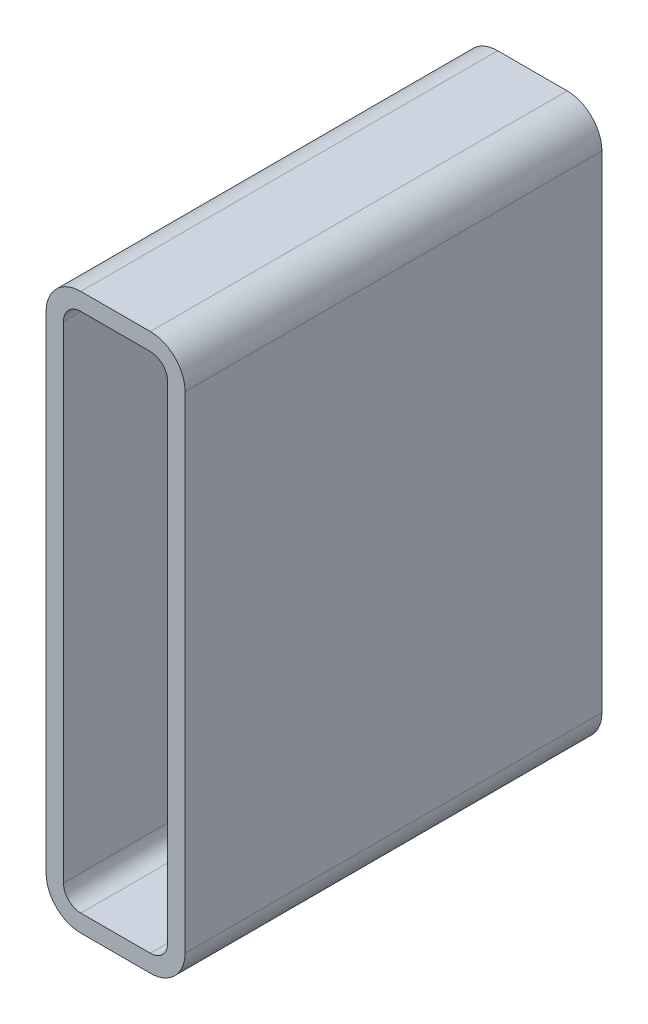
ISO-10303-21;
HEADER;
FILE_DESCRIPTION(('STEP AP214'),'2;1');
FILE_NAME('part.step','',(''),(''),'','','');
FILE_SCHEMA(('AUTOMOTIVE_DESIGN { 1 0 10303 214 1 1 1 1 }'));
ENDSEC;
DATA;
#1=APPLICATION_CONTEXT('core data for automotive mechanical design processes');
#2=APPLICATION_PROTOCOL_DEFINITION('international standard','automotive_design',2000,#1);
#3=PRODUCT_CONTEXT('',#1,'mechanical');
#4=PRODUCT('Part','Part','',(#3));
#5=PRODUCT_RELATED_PRODUCT_CATEGORY('part','',(#4));
#6=PRODUCT_DEFINITION_FORMATION('','',#4);
#7=PRODUCT_DEFINITION_CONTEXT('part definition',#1,'design');
#8=PRODUCT_DEFINITION('design','',#6,#7);
#9=PRODUCT_DEFINITION_SHAPE('','',#8);
#10=(LENGTH_UNIT() NAMED_UNIT(*) SI_UNIT(.MILLI.,.METRE.));
#11=(NAMED_UNIT(*) PLANE_ANGLE_UNIT() SI_UNIT($,.RADIAN.));
#12=(NAMED_UNIT(*) SI_UNIT($,.STERADIAN.) SOLID_ANGLE_UNIT());
#13=UNCERTAINTY_MEASURE_WITH_UNIT(LENGTH_MEASURE(1.E-05),#10,'distance_accuracy_value','');
#14=(GEOMETRIC_REPRESENTATION_CONTEXT(3) GLOBAL_UNCERTAINTY_ASSIGNED_CONTEXT((#13)) GLOBAL_UNIT_ASSIGNED_CONTEXT((#10,
#11,#12)) REPRESENTATION_CONTEXT('',''));
#15=CARTESIAN_POINT('',(0.,0.,0.));
#16=DIRECTION('',(0.,0.,1.));
#17=DIRECTION('',(1.,0.,0.));
#18=AXIS2_PLACEMENT_3D('',#15,#16,#17);
#19=CARTESIAN_POINT('',(27.0751778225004,382.782862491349,304.8));
#20=DIRECTION('',(0.,0.,1.));
#21=DIRECTION('',(1.,0.,0.));
#22=AXIS2_PLACEMENT_3D('',#19,#20,#21);
#23=PLANE('',#22);
#24=CARTESIAN_POINT('',(27.0751778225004,382.782862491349,304.8));
#25=DIRECTION('',(0.,0.,1.));
#26=DIRECTION('',(1.,0.,0.));
#27=AXIS2_PLACEMENT_3D('',#24,#25,#26);
#28=CIRCLE('',#27,25.4);
#29=CARTESIAN_POINT('',(27.0751778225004,408.182862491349,304.8));
#30=VERTEX_POINT('',#29);
#31=CARTESIAN_POINT('',(1.67517782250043,382.782862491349,304.8));
#32=VERTEX_POINT('',#31);
#33=EDGE_CURVE('E211',#30,#32,#28,.T.);
#34=ORIENTED_EDGE('',*,*,#33,.T.);
#35=DIRECTION('',(0.,-1.,0.));
#36=VECTOR('',#35,1.);
#37=CARTESIAN_POINT('',(1.67517782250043,27.1828624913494,304.8));
#38=LINE('',#37,#36);
#39=CARTESIAN_POINT('',(1.67517782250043,27.1828624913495,304.8));
#40=VERTEX_POINT('',#39);
#41=EDGE_CURVE('E214',#32,#40,#38,.T.);
#42=ORIENTED_EDGE('',*,*,#41,.T.);
#43=CARTESIAN_POINT('',(27.0751778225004,27.1828624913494,304.8));
#44=DIRECTION('',(0.,0.,1.));
#45=DIRECTION('',(1.,0.,0.));
#46=AXIS2_PLACEMENT_3D('',#43,#44,#45);
#47=CIRCLE('',#46,25.4);
#48=CARTESIAN_POINT('',(27.0751778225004,1.78286249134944,304.8));
#49=VERTEX_POINT('',#48);
#50=EDGE_CURVE('E217',#40,#49,#47,.T.);
#51=ORIENTED_EDGE('',*,*,#50,.T.);
#52=DIRECTION('',(1.,0.,0.));
#53=VECTOR('',#52,1.);
#54=CARTESIAN_POINT('',(77.8751778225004,1.78286249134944,304.8));
#55=LINE('',#54,#53);
#56=CARTESIAN_POINT('',(77.8751778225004,1.78286249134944,304.8));
#57=VERTEX_POINT('',#56);
#58=EDGE_CURVE('E219',#49,#57,#55,.T.);
#59=ORIENTED_EDGE('',*,*,#58,.T.);
#60=CARTESIAN_POINT('',(77.8751778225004,27.1828624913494,304.8));
#61=DIRECTION('',(0.,0.,1.));
#62=DIRECTION('',(1.,0.,0.));
#63=AXIS2_PLACEMENT_3D('',#60,#61,#62);
#64=CIRCLE('',#63,25.4);
#65=CARTESIAN_POINT('',(103.2751778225,27.1828624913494,304.8));
#66=VERTEX_POINT('',#65);
#67=EDGE_CURVE('E221',#57,#66,#64,.T.);
#68=ORIENTED_EDGE('',*,*,#67,.T.);
#69=DIRECTION('',(0.,1.,0.));
#70=VECTOR('',#69,1.);
#71=CARTESIAN_POINT('',(103.2751778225,382.782862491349,304.8));
#72=LINE('',#71,#70);
#73=CARTESIAN_POINT('',(103.2751778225,382.782862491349,304.8));
#74=VERTEX_POINT('',#73);
#75=EDGE_CURVE('E223',#66,#74,#72,.T.);
#76=ORIENTED_EDGE('',*,*,#75,.T.);
#77=CARTESIAN_POINT('',(77.8751778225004,382.782862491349,304.8));
#78=DIRECTION('',(0.,0.,1.));
#79=DIRECTION('',(1.,0.,0.));
#80=AXIS2_PLACEMENT_3D('',#77,#78,#79);
#81=CIRCLE('',#80,25.4);
#82=CARTESIAN_POINT('',(77.8751778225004,408.182862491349,304.8));
#83=VERTEX_POINT('',#82);
#84=EDGE_CURVE('E225',#74,#83,#81,.T.);
#85=ORIENTED_EDGE('',*,*,#84,.T.);
#86=DIRECTION('',(-1.,0.,0.));
#87=VECTOR('',#86,1.);
#88=CARTESIAN_POINT('',(27.0751778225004,408.182862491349,304.8));
#89=LINE('',#88,#87);
#90=EDGE_CURVE('E227',#83,#30,#89,.T.);
#91=ORIENTED_EDGE('',*,*,#90,.T.);
#92=EDGE_LOOP('',(#34,#42,#51,#59,#68,#76,#85,#91));
#93=FACE_BOUND('',#92,.T.);
#94=DIRECTION('',(0.,-1.,0.));
#95=VECTOR('',#94,1.);
#96=CARTESIAN_POINT('',(14.3751778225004,27.1828624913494,304.8));
#97=LINE('',#96,#95);
#98=CARTESIAN_POINT('',(14.3751778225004,382.782862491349,304.8));
#99=VERTEX_POINT('',#98);
#100=CARTESIAN_POINT('',(14.3751778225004,27.1828624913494,304.8));
#101=VERTEX_POINT('',#100);
#102=EDGE_CURVE('E154',#99,#101,#97,.T.);
#103=ORIENTED_EDGE('',*,*,#102,.F.);
#104=CARTESIAN_POINT('',(27.0751778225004,382.782862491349,304.8));
#105=DIRECTION('',(0.,0.,1.));
#106=DIRECTION('',(1.,0.,0.));
#107=AXIS2_PLACEMENT_3D('',#104,#105,#106);
#108=CIRCLE('',#107,12.7);
#109=CARTESIAN_POINT('',(27.0751778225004,395.482862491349,304.8));
#110=VERTEX_POINT('',#109);
#111=EDGE_CURVE('E146',#110,#99,#108,.T.);
#112=ORIENTED_EDGE('',*,*,#111,.F.);
#113=DIRECTION('',(-1.,0.,0.));
#114=VECTOR('',#113,1.);
#115=CARTESIAN_POINT('',(27.0751778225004,395.482862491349,304.8));
#116=LINE('',#115,#114);
#117=CARTESIAN_POINT('',(77.8751778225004,395.482862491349,304.8));
#118=VERTEX_POINT('',#117);
#119=EDGE_CURVE('E179',#118,#110,#116,.T.);
#120=ORIENTED_EDGE('',*,*,#119,.F.);
#121=CARTESIAN_POINT('',(77.8751778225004,382.782862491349,304.8));
#122=DIRECTION('',(0.,0.,1.));
#123=DIRECTION('',(1.,0.,0.));
#124=AXIS2_PLACEMENT_3D('',#121,#122,#123);
#125=CIRCLE('',#124,12.7);
#126=CARTESIAN_POINT('',(90.5751778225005,382.782862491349,304.8));
#127=VERTEX_POINT('',#126);
#128=EDGE_CURVE('E177',#127,#118,#125,.T.);
#129=ORIENTED_EDGE('',*,*,#128,.F.);
#130=DIRECTION('',(0.,1.,0.));
#131=VECTOR('',#130,1.);
#132=CARTESIAN_POINT('',(90.5751778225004,382.782862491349,304.8));
#133=LINE('',#132,#131);
#134=CARTESIAN_POINT('',(90.5751778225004,27.1828624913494,304.8));
#135=VERTEX_POINT('',#134);
#136=EDGE_CURVE('E175',#135,#127,#133,.T.);
#137=ORIENTED_EDGE('',*,*,#136,.F.);
#138=CARTESIAN_POINT('',(77.8751778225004,27.1828624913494,304.8));
#139=DIRECTION('',(0.,0.,1.));
#140=DIRECTION('',(1.,0.,0.));
#141=AXIS2_PLACEMENT_3D('',#138,#139,#140);
#142=CIRCLE('',#141,12.7);
#143=CARTESIAN_POINT('',(77.8751778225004,14.4828624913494,304.8));
#144=VERTEX_POINT('',#143);
#145=EDGE_CURVE('E173',#144,#135,#142,.T.);
#146=ORIENTED_EDGE('',*,*,#145,.F.);
#147=DIRECTION('',(1.,0.,0.));
#148=VECTOR('',#147,1.);
#149=CARTESIAN_POINT('',(77.8751778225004,14.4828624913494,304.8));
#150=LINE('',#149,#148);
#151=CARTESIAN_POINT('',(27.0751778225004,14.4828624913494,304.8));
#152=VERTEX_POINT('',#151);
#153=EDGE_CURVE('E169',#152,#144,#150,.T.);
#154=ORIENTED_EDGE('',*,*,#153,.F.);
#155=CARTESIAN_POINT('',(27.0751778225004,27.1828624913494,304.8));
#156=DIRECTION('',(0.,0.,1.));
#157=DIRECTION('',(1.,0.,0.));
#158=AXIS2_PLACEMENT_3D('',#155,#156,#157);
#159=CIRCLE('',#158,12.7);
#160=EDGE_CURVE('E167',#101,#152,#159,.T.);
#161=ORIENTED_EDGE('',*,*,#160,.F.);
#162=EDGE_LOOP('',(#103,#112,#120,#129,#137,#146,#154,#161));
#163=FACE_BOUND('',#162,.T.);
#164=ADVANCED_FACE('F33',(#93,#163),#23,.T.);
#165=CARTESIAN_POINT('',(27.0751778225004,382.782862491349,0.));
#166=DIRECTION('',(0.,0.,1.));
#167=DIRECTION('',(1.,0.,0.));
#168=AXIS2_PLACEMENT_3D('',#165,#166,#167);
#169=PLANE('',#168);
#170=CARTESIAN_POINT('',(27.0751778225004,382.782862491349,0.));
#171=DIRECTION('',(0.,0.,1.));
#172=DIRECTION('',(1.,0.,0.));
#173=AXIS2_PLACEMENT_3D('',#170,#171,#172);
#174=CIRCLE('',#173,25.4);
#175=CARTESIAN_POINT('',(27.0751778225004,408.182862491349,0.));
#176=VERTEX_POINT('',#175);
#177=CARTESIAN_POINT('',(1.67517782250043,382.782862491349,0.));
#178=VERTEX_POINT('',#177);
#179=EDGE_CURVE('E162',#176,#178,#174,.T.);
#180=ORIENTED_EDGE('',*,*,#179,.F.);
#181=DIRECTION('',(-1.,0.,0.));
#182=VECTOR('',#181,1.);
#183=CARTESIAN_POINT('',(27.0751778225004,408.182862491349,0.));
#184=LINE('',#183,#182);
#185=CARTESIAN_POINT('',(77.8751778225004,408.182862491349,0.));
#186=VERTEX_POINT('',#185);
#187=EDGE_CURVE('E215',#186,#176,#184,.T.);
#188=ORIENTED_EDGE('',*,*,#187,.F.);
#189=CARTESIAN_POINT('',(77.8751778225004,382.782862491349,0.));
#190=DIRECTION('',(0.,0.,1.));
#191=DIRECTION('',(1.,0.,0.));
#192=AXIS2_PLACEMENT_3D('',#189,#190,#191);
#193=CIRCLE('',#192,25.4);
#194=CARTESIAN_POINT('',(103.2751778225,382.782862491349,0.));
#195=VERTEX_POINT('',#194);
#196=EDGE_CURVE('E242',#195,#186,#193,.T.);
#197=ORIENTED_EDGE('',*,*,#196,.F.);
#198=DIRECTION('',(0.,1.,0.));
#199=VECTOR('',#198,1.);
#200=CARTESIAN_POINT('',(103.2751778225,382.782862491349,0.));
#201=LINE('',#200,#199);
#202=CARTESIAN_POINT('',(103.2751778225,27.1828624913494,0.));
#203=VERTEX_POINT('',#202);
#204=EDGE_CURVE('E240',#203,#195,#201,.T.);
#205=ORIENTED_EDGE('',*,*,#204,.F.);
#206=CARTESIAN_POINT('',(77.8751778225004,27.1828624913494,0.));
#207=DIRECTION('',(0.,0.,1.));
#208=DIRECTION('',(1.,0.,0.));
#209=AXIS2_PLACEMENT_3D('',#206,#207,#208);
#210=CIRCLE('',#209,25.4);
#211=CARTESIAN_POINT('',(77.8751778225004,1.78286249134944,0.));
#212=VERTEX_POINT('',#211);
#213=EDGE_CURVE('E238',#212,#203,#210,.T.);
#214=ORIENTED_EDGE('',*,*,#213,.F.);
#215=DIRECTION('',(1.,0.,0.));
#216=VECTOR('',#215,1.);
#217=CARTESIAN_POINT('',(77.8751778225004,1.78286249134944,0.));
#218=LINE('',#217,#216);
#219=CARTESIAN_POINT('',(27.0751778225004,1.78286249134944,0.));
#220=VERTEX_POINT('',#219);
#221=EDGE_CURVE('E236',#220,#212,#218,.T.);
#222=ORIENTED_EDGE('',*,*,#221,.F.);
#223=CARTESIAN_POINT('',(27.0751778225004,27.1828624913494,0.));
#224=DIRECTION('',(0.,0.,1.));
#225=DIRECTION('',(1.,0.,0.));
#226=AXIS2_PLACEMENT_3D('',#223,#224,#225);
#227=CIRCLE('',#226,25.4);
#228=CARTESIAN_POINT('',(1.67517782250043,27.1828624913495,0.));
#229=VERTEX_POINT('',#228);
#230=EDGE_CURVE('E234',#229,#220,#227,.T.);
#231=ORIENTED_EDGE('',*,*,#230,.F.);
#232=DIRECTION('',(0.,-1.,0.));
#233=VECTOR('',#232,1.);
#234=CARTESIAN_POINT('',(1.67517782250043,27.1828624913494,0.));
#235=LINE('',#234,#233);
#236=EDGE_CURVE('E232',#178,#229,#235,.T.);
#237=ORIENTED_EDGE('',*,*,#236,.F.);
#238=EDGE_LOOP('',(#180,#188,#197,#205,#214,#222,#231,#237));
#239=FACE_BOUND('',#238,.T.);
#240=CARTESIAN_POINT('',(27.0751778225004,382.782862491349,0.));
#241=DIRECTION('',(0.,0.,1.));
#242=DIRECTION('',(1.,0.,0.));
#243=AXIS2_PLACEMENT_3D('',#240,#241,#242);
#244=CIRCLE('',#243,12.7);
#245=CARTESIAN_POINT('',(27.0751778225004,395.482862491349,0.));
#246=VERTEX_POINT('',#245);
#247=CARTESIAN_POINT('',(14.3751778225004,382.782862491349,0.));
#248=VERTEX_POINT('',#247);
#249=EDGE_CURVE('E56',#246,#248,#244,.T.);
#250=ORIENTED_EDGE('',*,*,#249,.T.);
#251=DIRECTION('',(0.,-1.,0.));
#252=VECTOR('',#251,1.);
#253=CARTESIAN_POINT('',(14.3751778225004,27.1828624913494,0.));
#254=LINE('',#253,#252);
#255=CARTESIAN_POINT('',(14.3751778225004,27.1828624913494,0.));
#256=VERTEX_POINT('',#255);
#257=EDGE_CURVE('E161',#248,#256,#254,.T.);
#258=ORIENTED_EDGE('',*,*,#257,.T.);
#259=CARTESIAN_POINT('',(27.0751778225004,27.1828624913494,0.));
#260=DIRECTION('',(0.,0.,1.));
#261=DIRECTION('',(1.,0.,0.));
#262=AXIS2_PLACEMENT_3D('',#259,#260,#261);
#263=CIRCLE('',#262,12.7);
#264=CARTESIAN_POINT('',(27.0751778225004,14.4828624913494,0.));
#265=VERTEX_POINT('',#264);
#266=EDGE_CURVE('E183',#256,#265,#263,.T.);
#267=ORIENTED_EDGE('',*,*,#266,.T.);
#268=DIRECTION('',(1.,0.,0.));
#269=VECTOR('',#268,1.);
#270=CARTESIAN_POINT('',(77.8751778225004,14.4828624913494,0.));
#271=LINE('',#270,#269);
#272=CARTESIAN_POINT('',(77.8751778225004,14.4828624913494,0.));
#273=VERTEX_POINT('',#272);
#274=EDGE_CURVE('E186',#265,#273,#271,.T.);
#275=ORIENTED_EDGE('',*,*,#274,.T.);
#276=CARTESIAN_POINT('',(77.8751778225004,27.1828624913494,0.));
#277=DIRECTION('',(0.,0.,1.));
#278=DIRECTION('',(1.,0.,0.));
#279=AXIS2_PLACEMENT_3D('',#276,#277,#278);
#280=CIRCLE('',#279,12.7);
#281=CARTESIAN_POINT('',(90.5751778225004,27.1828624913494,0.));
#282=VERTEX_POINT('',#281);
#283=EDGE_CURVE('E189',#273,#282,#280,.T.);
#284=ORIENTED_EDGE('',*,*,#283,.T.);
#285=DIRECTION('',(0.,1.,0.));
#286=VECTOR('',#285,1.);
#287=CARTESIAN_POINT('',(90.5751778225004,382.782862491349,0.));
#288=LINE('',#287,#286);
#289=CARTESIAN_POINT('',(90.5751778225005,382.782862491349,0.));
#290=VERTEX_POINT('',#289);
#291=EDGE_CURVE('E192',#282,#290,#288,.T.);
#292=ORIENTED_EDGE('',*,*,#291,.T.);
#293=CARTESIAN_POINT('',(77.8751778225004,382.782862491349,0.));
#294=DIRECTION('',(0.,0.,1.));
#295=DIRECTION('',(1.,0.,0.));
#296=AXIS2_PLACEMENT_3D('',#293,#294,#295);
#297=CIRCLE('',#296,12.7);
#298=CARTESIAN_POINT('',(77.8751778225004,395.482862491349,0.));
#299=VERTEX_POINT('',#298);
#300=EDGE_CURVE('E195',#290,#299,#297,.T.);
#301=ORIENTED_EDGE('',*,*,#300,.T.);
#302=DIRECTION('',(-1.,0.,0.));
#303=VECTOR('',#302,1.);
#304=CARTESIAN_POINT('',(27.0751778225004,395.482862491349,0.));
#305=LINE('',#304,#303);
#306=EDGE_CURVE('E155',#299,#246,#305,.T.);
#307=ORIENTED_EDGE('',*,*,#306,.T.);
#308=EDGE_LOOP('',(#250,#258,#267,#275,#284,#292,#301,#307));
#309=FACE_BOUND('',#308,.T.);
#310=ADVANCED_FACE('F272',(#239,#309),#169,.F.);
#311=CARTESIAN_POINT('',(27.0751778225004,382.782862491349,304.8));
#312=DIRECTION('',(0.,0.,-1.));
#313=DIRECTION('',(-1.,0.,0.));
#314=AXIS2_PLACEMENT_3D('',#311,#312,#313);
#315=CYLINDRICAL_SURFACE('',#314,25.4);
#316=ORIENTED_EDGE('',*,*,#179,.T.);
#317=DIRECTION('',(0.,0.,-1.));
#318=VECTOR('',#317,1.);
#319=CARTESIAN_POINT('',(1.67517782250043,382.782862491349,304.8));
#320=LINE('',#319,#318);
#321=EDGE_CURVE('E11',#32,#178,#320,.T.);
#322=ORIENTED_EDGE('',*,*,#321,.F.);
#323=ORIENTED_EDGE('',*,*,#33,.F.);
#324=DIRECTION('',(0.,0.,-1.));
#325=VECTOR('',#324,1.);
#326=CARTESIAN_POINT('',(27.0751778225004,408.182862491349,304.8));
#327=LINE('',#326,#325);
#328=EDGE_CURVE('E229',#30,#176,#327,.T.);
#329=ORIENTED_EDGE('',*,*,#328,.T.);
#330=EDGE_LOOP('',(#316,#322,#323,#329));
#331=FACE_BOUND('',#330,.T.);
#332=ADVANCED_FACE('F35',(#331),#315,.T.);
#333=CARTESIAN_POINT('',(1.67517782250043,27.1828624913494,304.8));
#334=DIRECTION('',(1.,0.,0.));
#335=DIRECTION('',(0.,0.,-1.));
#336=AXIS2_PLACEMENT_3D('',#333,#334,#335);
#337=PLANE('',#336);
#338=ORIENTED_EDGE('',*,*,#236,.T.);
#339=DIRECTION('',(0.,0.,-1.));
#340=VECTOR('',#339,1.);
#341=CARTESIAN_POINT('',(1.67517782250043,27.1828624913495,304.8));
#342=LINE('',#341,#340);
#343=EDGE_CURVE('E41',#40,#229,#342,.T.);
#344=ORIENTED_EDGE('',*,*,#343,.F.);
#345=ORIENTED_EDGE('',*,*,#41,.F.);
#346=ORIENTED_EDGE('',*,*,#321,.T.);
#347=EDGE_LOOP('',(#338,#344,#345,#346));
#348=FACE_BOUND('',#347,.T.);
#349=ADVANCED_FACE('F289',(#348),#337,.F.);
#350=CARTESIAN_POINT('',(27.0751778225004,27.1828624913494,304.8));
#351=DIRECTION('',(0.,0.,-1.));
#352=DIRECTION('',(-1.,0.,0.));
#353=AXIS2_PLACEMENT_3D('',#350,#351,#352);
#354=CYLINDRICAL_SURFACE('',#353,25.4);
#355=ORIENTED_EDGE('',*,*,#230,.T.);
#356=DIRECTION('',(0.,0.,-1.));
#357=VECTOR('',#356,1.);
#358=CARTESIAN_POINT('',(27.0751778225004,1.78286249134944,304.8));
#359=LINE('',#358,#357);
#360=EDGE_CURVE('E259',#49,#220,#359,.T.);
#361=ORIENTED_EDGE('',*,*,#360,.F.);
#362=ORIENTED_EDGE('',*,*,#50,.F.);
#363=ORIENTED_EDGE('',*,*,#343,.T.);
#364=EDGE_LOOP('',(#355,#361,#362,#363));
#365=FACE_BOUND('',#364,.T.);
#366=ADVANCED_FACE('F266',(#365),#354,.T.);
#367=CARTESIAN_POINT('',(77.8751778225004,1.78286249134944,304.8));
#368=DIRECTION('',(0.,1.,0.));
#369=DIRECTION('',(0.,0.,1.));
#370=AXIS2_PLACEMENT_3D('',#367,#368,#369);
#371=PLANE('',#370);
#372=ORIENTED_EDGE('',*,*,#221,.T.);
#373=DIRECTION('',(0.,0.,-1.));
#374=VECTOR('',#373,1.);
#375=CARTESIAN_POINT('',(77.8751778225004,1.78286249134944,304.8));
#376=LINE('',#375,#374);
#377=EDGE_CURVE('E256',#57,#212,#376,.T.);
#378=ORIENTED_EDGE('',*,*,#377,.F.);
#379=ORIENTED_EDGE('',*,*,#58,.F.);
#380=ORIENTED_EDGE('',*,*,#360,.T.);
#381=EDGE_LOOP('',(#372,#378,#379,#380));
#382=FACE_BOUND('',#381,.T.);
#383=ADVANCED_FACE('F278',(#382),#371,.F.);
#384=CARTESIAN_POINT('',(77.8751778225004,27.1828624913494,304.8));
#385=DIRECTION('',(0.,0.,-1.));
#386=DIRECTION('',(-1.,0.,0.));
#387=AXIS2_PLACEMENT_3D('',#384,#385,#386);
#388=CYLINDRICAL_SURFACE('',#387,25.4);
#389=ORIENTED_EDGE('',*,*,#213,.T.);
#390=DIRECTION('',(0.,0.,-1.));
#391=VECTOR('',#390,1.);
#392=CARTESIAN_POINT('',(103.2751778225,27.1828624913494,304.8));
#393=LINE('',#392,#391);
#394=EDGE_CURVE('E253',#66,#203,#393,.T.);
#395=ORIENTED_EDGE('',*,*,#394,.F.);
#396=ORIENTED_EDGE('',*,*,#67,.F.);
#397=ORIENTED_EDGE('',*,*,#377,.T.);
#398=EDGE_LOOP('',(#389,#395,#396,#397));
#399=FACE_BOUND('',#398,.T.);
#400=ADVANCED_FACE('F282',(#399),#388,.T.);
#401=CARTESIAN_POINT('',(103.2751778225,382.782862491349,304.8));
#402=DIRECTION('',(-1.,0.,0.));
#403=DIRECTION('',(0.,0.,1.));
#404=AXIS2_PLACEMENT_3D('',#401,#402,#403);
#405=PLANE('',#404);
#406=ORIENTED_EDGE('',*,*,#204,.T.);
#407=DIRECTION('',(0.,0.,-1.));
#408=VECTOR('',#407,1.);
#409=CARTESIAN_POINT('',(103.2751778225,382.782862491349,304.8));
#410=LINE('',#409,#408);
#411=EDGE_CURVE('E250',#74,#195,#410,.T.);
#412=ORIENTED_EDGE('',*,*,#411,.F.);
#413=ORIENTED_EDGE('',*,*,#75,.F.);
#414=ORIENTED_EDGE('',*,*,#394,.T.);
#415=EDGE_LOOP('',(#406,#412,#413,#414));
#416=FACE_BOUND('',#415,.T.);
#417=ADVANCED_FACE('F302',(#416),#405,.F.);
#418=CARTESIAN_POINT('',(77.8751778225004,382.782862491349,304.8));
#419=DIRECTION('',(0.,0.,-1.));
#420=DIRECTION('',(-1.,0.,0.));
#421=AXIS2_PLACEMENT_3D('',#418,#419,#420);
#422=CYLINDRICAL_SURFACE('',#421,25.4);
#423=ORIENTED_EDGE('',*,*,#196,.T.);
#424=DIRECTION('',(0.,0.,-1.));
#425=VECTOR('',#424,1.);
#426=CARTESIAN_POINT('',(77.8751778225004,408.182862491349,304.8));
#427=LINE('',#426,#425);
#428=EDGE_CURVE('E247',#83,#186,#427,.T.);
#429=ORIENTED_EDGE('',*,*,#428,.F.);
#430=ORIENTED_EDGE('',*,*,#84,.F.);
#431=ORIENTED_EDGE('',*,*,#411,.T.);
#432=EDGE_LOOP('',(#423,#429,#430,#431));
#433=FACE_BOUND('',#432,.T.);
#434=ADVANCED_FACE('F300',(#433),#422,.T.);
#435=CARTESIAN_POINT('',(27.0751778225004,408.182862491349,304.8));
#436=DIRECTION('',(0.,-1.,0.));
#437=DIRECTION('',(0.,0.,-1.));
#438=AXIS2_PLACEMENT_3D('',#435,#436,#437);
#439=PLANE('',#438);
#440=ORIENTED_EDGE('',*,*,#187,.T.);
#441=ORIENTED_EDGE('',*,*,#328,.F.);
#442=ORIENTED_EDGE('',*,*,#90,.F.);
#443=ORIENTED_EDGE('',*,*,#428,.T.);
#444=EDGE_LOOP('',(#440,#441,#442,#443));
#445=FACE_BOUND('',#444,.T.);
#446=ADVANCED_FACE('F295',(#445),#439,.F.);
#447=CARTESIAN_POINT('',(27.0751778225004,382.782862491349,304.8));
#448=DIRECTION('',(0.,0.,-1.));
#449=DIRECTION('',(-1.,0.,0.));
#450=AXIS2_PLACEMENT_3D('',#447,#448,#449);
#451=CYLINDRICAL_SURFACE('',#450,12.7);
#452=ORIENTED_EDGE('',*,*,#249,.F.);
#453=DIRECTION('',(0.,0.,-1.));
#454=VECTOR('',#453,1.);
#455=CARTESIAN_POINT('',(27.0751778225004,395.482862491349,304.8));
#456=LINE('',#455,#454);
#457=EDGE_CURVE('E150',#110,#246,#456,.T.);
#458=ORIENTED_EDGE('',*,*,#457,.F.);
#459=ORIENTED_EDGE('',*,*,#111,.T.);
#460=DIRECTION('',(0.,0.,-1.));
#461=VECTOR('',#460,1.);
#462=CARTESIAN_POINT('',(14.3751778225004,382.782862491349,304.8));
#463=LINE('',#462,#461);
#464=EDGE_CURVE('E149',#99,#248,#463,.T.);
#465=ORIENTED_EDGE('',*,*,#464,.T.);
#466=EDGE_LOOP('',(#452,#458,#459,#465));
#467=FACE_BOUND('',#466,.T.);
#468=ADVANCED_FACE('F148',(#467),#451,.F.);
#469=CARTESIAN_POINT('',(14.3751778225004,27.1828624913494,304.8));
#470=DIRECTION('',(1.,0.,0.));
#471=DIRECTION('',(0.,0.,-1.));
#472=AXIS2_PLACEMENT_3D('',#469,#470,#471);
#473=PLANE('',#472);
#474=ORIENTED_EDGE('',*,*,#257,.F.);
#475=ORIENTED_EDGE('',*,*,#464,.F.);
#476=ORIENTED_EDGE('',*,*,#102,.T.);
#477=DIRECTION('',(0.,0.,-1.));
#478=VECTOR('',#477,1.);
#479=CARTESIAN_POINT('',(14.3751778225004,27.1828624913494,304.8));
#480=LINE('',#479,#478);
#481=EDGE_CURVE('E163',#101,#256,#480,.T.);
#482=ORIENTED_EDGE('',*,*,#481,.T.);
#483=EDGE_LOOP('',(#474,#475,#476,#482));
#484=FACE_BOUND('',#483,.T.);
#485=ADVANCED_FACE('F158',(#484),#473,.T.);
#486=CARTESIAN_POINT('',(27.0751778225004,27.1828624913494,304.8));
#487=DIRECTION('',(0.,0.,-1.));
#488=DIRECTION('',(-1.,0.,0.));
#489=AXIS2_PLACEMENT_3D('',#486,#487,#488);
#490=CYLINDRICAL_SURFACE('',#489,12.7);
#491=ORIENTED_EDGE('',*,*,#266,.F.);
#492=ORIENTED_EDGE('',*,*,#481,.F.);
#493=ORIENTED_EDGE('',*,*,#160,.T.);
#494=DIRECTION('',(0.,0.,-1.));
#495=VECTOR('',#494,1.);
#496=CARTESIAN_POINT('',(27.0751778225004,14.4828624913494,304.8));
#497=LINE('',#496,#495);
#498=EDGE_CURVE('E208',#152,#265,#497,.T.);
#499=ORIENTED_EDGE('',*,*,#498,.T.);
#500=EDGE_LOOP('',(#491,#492,#493,#499));
#501=FACE_BOUND('',#500,.T.);
#502=ADVANCED_FACE('F327',(#501),#490,.F.);
#503=CARTESIAN_POINT('',(77.8751778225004,14.4828624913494,304.8));
#504=DIRECTION('',(0.,1.,0.));
#505=DIRECTION('',(0.,0.,1.));
#506=AXIS2_PLACEMENT_3D('',#503,#504,#505);
#507=PLANE('',#506);
#508=ORIENTED_EDGE('',*,*,#274,.F.);
#509=ORIENTED_EDGE('',*,*,#498,.F.);
#510=ORIENTED_EDGE('',*,*,#153,.T.);
#511=DIRECTION('',(0.,0.,-1.));
#512=VECTOR('',#511,1.);
#513=CARTESIAN_POINT('',(77.8751778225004,14.4828624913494,304.8));
#514=LINE('',#513,#512);
#515=EDGE_CURVE('E206',#144,#273,#514,.T.);
#516=ORIENTED_EDGE('',*,*,#515,.T.);
#517=EDGE_LOOP('',(#508,#509,#510,#516));
#518=FACE_BOUND('',#517,.T.);
#519=ADVANCED_FACE('F331',(#518),#507,.T.);
#520=CARTESIAN_POINT('',(77.8751778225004,27.1828624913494,304.8));
#521=DIRECTION('',(0.,0.,-1.));
#522=DIRECTION('',(-1.,0.,0.));
#523=AXIS2_PLACEMENT_3D('',#520,#521,#522);
#524=CYLINDRICAL_SURFACE('',#523,12.7);
#525=ORIENTED_EDGE('',*,*,#283,.F.);
#526=ORIENTED_EDGE('',*,*,#515,.F.);
#527=ORIENTED_EDGE('',*,*,#145,.T.);
#528=DIRECTION('',(0.,0.,-1.));
#529=VECTOR('',#528,1.);
#530=CARTESIAN_POINT('',(90.5751778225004,27.1828624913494,304.8));
#531=LINE('',#530,#529);
#532=EDGE_CURVE('E204',#135,#282,#531,.T.);
#533=ORIENTED_EDGE('',*,*,#532,.T.);
#534=EDGE_LOOP('',(#525,#526,#527,#533));
#535=FACE_BOUND('',#534,.T.);
#536=ADVANCED_FACE('F337',(#535),#524,.F.);
#537=CARTESIAN_POINT('',(90.5751778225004,382.782862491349,304.8));
#538=DIRECTION('',(-1.,0.,0.));
#539=DIRECTION('',(0.,0.,1.));
#540=AXIS2_PLACEMENT_3D('',#537,#538,#539);
#541=PLANE('',#540);
#542=ORIENTED_EDGE('',*,*,#291,.F.);
#543=ORIENTED_EDGE('',*,*,#532,.F.);
#544=ORIENTED_EDGE('',*,*,#136,.T.);
#545=DIRECTION('',(0.,0.,-1.));
#546=VECTOR('',#545,1.);
#547=CARTESIAN_POINT('',(90.5751778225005,382.782862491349,304.8));
#548=LINE('',#547,#546);
#549=EDGE_CURVE('E202',#127,#290,#548,.T.);
#550=ORIENTED_EDGE('',*,*,#549,.T.);
#551=EDGE_LOOP('',(#542,#543,#544,#550));
#552=FACE_BOUND('',#551,.T.);
#553=ADVANCED_FACE('F341',(#552),#541,.T.);
#554=CARTESIAN_POINT('',(77.8751778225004,382.782862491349,304.8));
#555=DIRECTION('',(0.,0.,-1.));
#556=DIRECTION('',(-1.,0.,0.));
#557=AXIS2_PLACEMENT_3D('',#554,#555,#556);
#558=CYLINDRICAL_SURFACE('',#557,12.7);
#559=ORIENTED_EDGE('',*,*,#300,.F.);
#560=ORIENTED_EDGE('',*,*,#549,.F.);
#561=ORIENTED_EDGE('',*,*,#128,.T.);
#562=DIRECTION('',(0.,0.,-1.));
#563=VECTOR('',#562,1.);
#564=CARTESIAN_POINT('',(77.8751778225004,395.482862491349,304.8));
#565=LINE('',#564,#563);
#566=EDGE_CURVE('E48',#118,#299,#565,.T.);
#567=ORIENTED_EDGE('',*,*,#566,.T.);
#568=EDGE_LOOP('',(#559,#560,#561,#567));
#569=FACE_BOUND('',#568,.T.);
#570=ADVANCED_FACE('F345',(#569),#558,.F.);
#571=CARTESIAN_POINT('',(27.0751778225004,395.482862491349,304.8));
#572=DIRECTION('',(0.,-1.,0.));
#573=DIRECTION('',(0.,0.,-1.));
#574=AXIS2_PLACEMENT_3D('',#571,#572,#573);
#575=PLANE('',#574);
#576=ORIENTED_EDGE('',*,*,#306,.F.);
#577=ORIENTED_EDGE('',*,*,#566,.F.);
#578=ORIENTED_EDGE('',*,*,#119,.T.);
#579=ORIENTED_EDGE('',*,*,#457,.T.);
#580=EDGE_LOOP('',(#576,#577,#578,#579));
#581=FACE_BOUND('',#580,.T.);
#582=ADVANCED_FACE('F349',(#581),#575,.T.);
#583=CLOSED_SHELL('',(#164,#310,#332,#349,#366,#383,#400,#417,#434,#446,#468,#485,#502,#519,
#536,#553,#570,#582));
#584=MANIFOLD_SOLID_BREP('B2',#583);
#585=ADVANCED_BREP_SHAPE_REPRESENTATION('',(#18,#584),#14);
#586=SHAPE_DEFINITION_REPRESENTATION(#9,#585);
ENDSEC;
END-ISO-10303-21;
